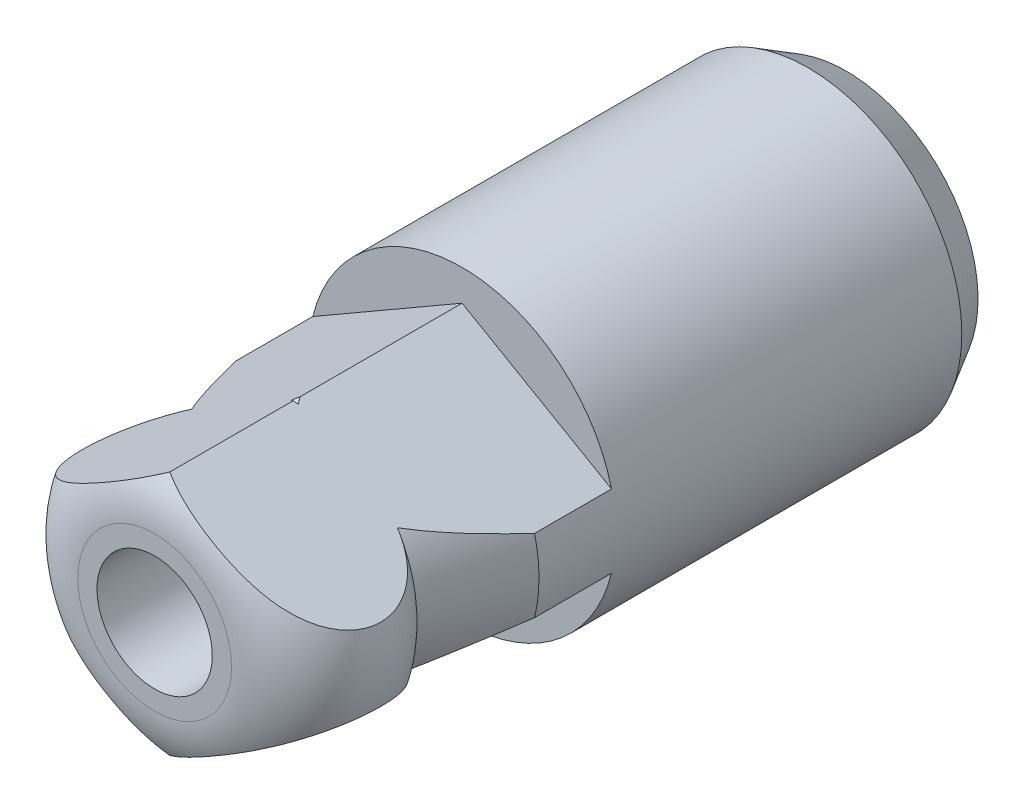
ISO-10303-21;
HEADER;
FILE_DESCRIPTION(('STEP AP214'),'2;1');
FILE_NAME('part.step','',(''),(''),'','','');
FILE_SCHEMA(('AUTOMOTIVE_DESIGN { 1 0 10303 214 1 1 1 1 }'));
ENDSEC;
DATA;
#1=APPLICATION_CONTEXT('core data for automotive mechanical design processes');
#2=APPLICATION_PROTOCOL_DEFINITION('international standard','automotive_design',2000,#1);
#3=PRODUCT_CONTEXT('',#1,'mechanical');
#4=PRODUCT('Part','Part','',(#3));
#5=PRODUCT_RELATED_PRODUCT_CATEGORY('part','',(#4));
#6=PRODUCT_DEFINITION_FORMATION('','',#4);
#7=PRODUCT_DEFINITION_CONTEXT('part definition',#1,'design');
#8=PRODUCT_DEFINITION('design','',#6,#7);
#9=PRODUCT_DEFINITION_SHAPE('','',#8);
#10=(LENGTH_UNIT() NAMED_UNIT(*) SI_UNIT(.MILLI.,.METRE.));
#11=(NAMED_UNIT(*) PLANE_ANGLE_UNIT() SI_UNIT($,.RADIAN.));
#12=(NAMED_UNIT(*) SI_UNIT($,.STERADIAN.) SOLID_ANGLE_UNIT());
#13=UNCERTAINTY_MEASURE_WITH_UNIT(LENGTH_MEASURE(1.E-05),#10,'distance_accuracy_value','');
#14=(GEOMETRIC_REPRESENTATION_CONTEXT(3) GLOBAL_UNCERTAINTY_ASSIGNED_CONTEXT((#13)) GLOBAL_UNIT_ASSIGNED_CONTEXT((#10,
#11,#12)) REPRESENTATION_CONTEXT('',''));
#15=CARTESIAN_POINT('',(0.,0.,0.));
#16=DIRECTION('',(0.,0.,1.));
#17=DIRECTION('',(1.,0.,0.));
#18=AXIS2_PLACEMENT_3D('',#15,#16,#17);
#19=CARTESIAN_POINT('',(0.,0.,14.3579455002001));
#20=DIRECTION('',(0.,0.,-1.));
#21=DIRECTION('',(0.,-1.,0.));
#22=AXIS2_PLACEMENT_3D('',#19,#20,#21);
#23=CONICAL_SURFACE('',#22,3.14177800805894,0.349065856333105);
#24=CARTESIAN_POINT('',(5.10090684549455,-0.248313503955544,8.95868747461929));
#25=CARTESIAN_POINT('',(5.02230281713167,-0.29369555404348,9.1682870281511));
#26=CARTESIAN_POINT('',(4.94310958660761,-0.339417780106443,9.37759561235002));
#27=CARTESIAN_POINT('',(4.78322479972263,-0.4317272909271,9.79548140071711));
#28=CARTESIAN_POINT('',(4.70253304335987,-0.478314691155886,10.0040585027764));
#29=CARTESIAN_POINT('',(4.53934034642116,-0.572534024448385,10.4203057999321));
#30=CARTESIAN_POINT('',(4.4568391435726,-0.620166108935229,10.6279758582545));
#31=CARTESIAN_POINT('',(4.28960424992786,-0.716719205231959,11.0420965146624));
#32=CARTESIAN_POINT('',(4.20487073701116,-0.765640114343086,11.2485472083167));
#33=CARTESIAN_POINT('',(4.03253434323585,-0.86513856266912,11.6599398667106));
#34=CARTESIAN_POINT('',(3.9449304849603,-0.915716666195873,11.8648812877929));
#35=CARTESIAN_POINT('',(3.76599563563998,-1.01902473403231,12.2726470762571));
#36=CARTESIAN_POINT('',(3.67466382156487,-1.07175517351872,12.4754709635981));
#37=CARTESIAN_POINT('',(3.48677846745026,-1.18023081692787,12.8785509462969));
#38=CARTESIAN_POINT('',(3.39021261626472,-1.23598312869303,13.078799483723));
#39=CARTESIAN_POINT('',(3.24005501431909,-1.32267664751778,13.3755398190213));
#40=CARTESIAN_POINT('',(3.18912863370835,-1.35207900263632,13.4738281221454));
#41=CARTESIAN_POINT('',(3.08510348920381,-1.41213793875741,13.6688555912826));
#42=CARTESIAN_POINT('',(3.03200491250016,-1.44279441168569,13.7655948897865));
#43=CARTESIAN_POINT('',(2.92275465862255,-1.50587006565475,13.9577003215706));
#44=CARTESIAN_POINT('',(2.86658468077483,-1.53829981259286,14.0530526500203));
#45=CARTESIAN_POINT('',(2.75077460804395,-1.60516277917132,14.2410168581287));
#46=CARTESIAN_POINT('',(2.69113246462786,-1.63959718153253,14.3336270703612));
#47=CARTESIAN_POINT('',(2.56772549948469,-1.71084621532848,14.5143853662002));
#48=CARTESIAN_POINT('',(2.50398309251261,-1.74764790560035,14.6025536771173));
#49=CARTESIAN_POINT('',(2.37078421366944,-1.82455030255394,14.772871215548));
#50=CARTESIAN_POINT('',(2.30133577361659,-1.86464637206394,14.8550286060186));
#51=CARTESIAN_POINT('',(2.17765147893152,-1.93605552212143,14.985605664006));
#52=CARTESIAN_POINT('',(2.12543669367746,-1.96620173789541,15.036549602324));
#53=CARTESIAN_POINT('',(2.0165315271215,-2.02907815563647,15.1319817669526));
#54=CARTESIAN_POINT('',(1.95983412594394,-2.06181241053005,15.1764595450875));
#55=CARTESIAN_POINT('',(1.84056307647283,-2.13067357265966,15.256434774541));
#56=CARTESIAN_POINT('',(1.77791312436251,-2.16684453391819,15.2917852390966));
#57=CARTESIAN_POINT('',(1.64796425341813,-2.24187053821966,15.3480027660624));
#58=CARTESIAN_POINT('',(1.58068691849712,-2.28071311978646,15.3689326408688));
#59=CARTESIAN_POINT('',(1.46217849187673,-2.34913398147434,15.3892478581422));
#60=CARTESIAN_POINT('',(1.41149721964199,-2.3783948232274,15.3929131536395));
#61=CARTESIAN_POINT('',(1.31033177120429,-2.4368027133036,15.3899827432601));
#62=CARTESIAN_POINT('',(1.25984770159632,-2.46594970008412,15.383382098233));
#63=CARTESIAN_POINT('',(1.16081838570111,-2.52312429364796,15.3608180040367));
#64=CARTESIAN_POINT('',(1.11226395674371,-2.55115720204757,15.3449065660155));
#65=CARTESIAN_POINT('',(1.01761286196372,-2.60580402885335,15.3054106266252));
#66=CARTESIAN_POINT('',(0.971516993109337,-2.63241748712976,15.281823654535));
#67=CARTESIAN_POINT('',(0.843528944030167,-2.70631141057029,15.2059057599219));
#68=CARTESIAN_POINT('',(0.764896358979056,-2.75170994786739,15.146286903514));
#69=CARTESIAN_POINT('',(0.653104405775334,-2.81625305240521,15.0477906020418));
#70=CARTESIAN_POINT('',(0.616775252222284,-2.83722769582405,15.0133398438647));
#71=CARTESIAN_POINT('',(0.545936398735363,-2.8781265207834,14.9420255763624));
#72=CARTESIAN_POINT('',(0.511426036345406,-2.89805108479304,14.9051629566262));
#73=CARTESIAN_POINT('',(0.42374636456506,-2.94867295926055,14.8068419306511));
#74=CARTESIAN_POINT('',(0.371823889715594,-2.97865040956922,14.7439125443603));
#75=CARTESIAN_POINT('',(0.271245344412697,-3.0367194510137,14.6146418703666));
#76=CARTESIAN_POINT('',(0.222591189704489,-3.06480993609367,14.5482986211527));
#77=CARTESIAN_POINT('',(0.127856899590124,-3.11950479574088,14.4129964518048));
#78=CARTESIAN_POINT('',(0.0817822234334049,-3.14610601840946,14.3440324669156));
#79=CARTESIAN_POINT('',(-0.00817110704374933,-3.19804059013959,14.2042139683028));
#80=CARTESIAN_POINT('',(-0.0520493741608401,-3.22337371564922,14.1333591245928));
#81=CARTESIAN_POINT('',(-0.181737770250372,-3.29824933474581,13.9173373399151));
#82=CARTESIAN_POINT('',(-0.26476492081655,-3.34618507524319,13.7699455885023));
#83=CARTESIAN_POINT('',(-0.425453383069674,-3.43895858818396,13.4716394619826));
#84=CARTESIAN_POINT('',(-0.503121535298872,-3.48380031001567,13.3207299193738));
#85=CARTESIAN_POINT('',(-0.664878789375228,-3.5771908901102,12.9955690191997));
#86=CARTESIAN_POINT('',(-0.748398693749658,-3.62541112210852,12.8209415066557));
#87=CARTESIAN_POINT('',(-0.911696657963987,-3.71969123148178,12.4693612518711));
#88=CARTESIAN_POINT('',(-0.991474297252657,-3.76575086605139,12.2924082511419));
#89=CARTESIAN_POINT('',(-1.14821908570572,-3.85624749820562,11.9366287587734));
#90=CARTESIAN_POINT('',(-1.22518328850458,-3.90068279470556,11.7578005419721));
#91=CARTESIAN_POINT('',(-1.37682566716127,-3.9882335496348,11.398855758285));
#92=CARTESIAN_POINT('',(-1.45150379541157,-4.03134898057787,11.218739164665));
#93=CARTESIAN_POINT('',(-1.59551033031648,-4.11449117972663,10.8660809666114));
#94=CARTESIAN_POINT('',(-1.66492436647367,-4.15456738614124,10.6935858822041));
#95=CARTESIAN_POINT('',(-1.80236420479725,-4.23391830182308,10.3478572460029));
#96=CARTESIAN_POINT('',(-1.87038998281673,-4.27319299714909,10.1746236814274));
#97=CARTESIAN_POINT('',(-2.00514633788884,-4.35099460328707,9.8278884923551));
#98=CARTESIAN_POINT('',(-2.07187916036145,-4.38952281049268,9.65438802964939));
#99=CARTESIAN_POINT('',(-2.20434844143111,-4.4660039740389,9.3068891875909));
#100=CARTESIAN_POINT('',(-2.27008494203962,-4.50395695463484,9.13289082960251));
#101=CARTESIAN_POINT('',(-2.33540821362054,-4.54167135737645,8.95868747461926));
#102=B_SPLINE_CURVE_WITH_KNOTS('',3,(#24,#25,#26,#27,#28,#29,#30,#31,#32,#33,#34,#35,#36,#37,
#38,#39,#40,#41,#42,#43,#44,#45,#46,#47,#48,#49,#50,#51,#52,#53,#54,#55,#56,#57,#58,#59,#60,#61,
#62,#63,#64,#65,#66,#67,#68,#69,#70,#71,#72,#73,#74,#75,#76,#77,#78,#79,#80,#81,#82,#83,#84,#85,
#86,#87,#88,#89,#90,#91,#92,#93,#94,#95,#96,#97,#98,#99,#100,#101),.UNSPECIFIED.,.F.,.F.,(4,2,2,
2,2,2,2,2,2,2,2,2,2,2,2,2,2,2,2,2,2,2,2,2,2,2,2,2,2,2,2,2,2,2,2,2,2,2,4),(0.,0.685227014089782,
1.3705461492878,2.05596528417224,2.74132996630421,3.42693050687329,4.11268323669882,
4.80012556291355,5.14370622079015,5.48725733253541,5.83314383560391,6.17923651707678,
6.52357599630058,6.86743882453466,7.10393082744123,7.34080081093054,7.5812760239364,
7.8206970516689,7.99573755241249,8.17086229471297,8.34501798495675,8.51922979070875,
8.84307091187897,9.00588925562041,9.16864788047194,9.42919365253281,9.68989083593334,
9.9511203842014,10.2123958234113,10.7396359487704,11.2661901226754,11.8645663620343,
12.4630096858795,13.0620627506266,13.6611282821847,14.2317417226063,14.8023650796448,
15.3718876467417,15.9413861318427),.UNSPECIFIED.);
#103=CARTESIAN_POINT('',(3.88555,-0.95,12.0000004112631));
#104=VERTEX_POINT('',#103);
#105=CARTESIAN_POINT('',(2.67390717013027,-1.64954220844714,14.3579455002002));
#106=VERTEX_POINT('',#105);
#107=EDGE_CURVE('E167',#104,#106,#102,.T.);
#108=ORIENTED_EDGE('',*,*,#107,.F.);
#109=CARTESIAN_POINT('',(0.,0.,12.));
#110=DIRECTION('',(0.,0.,-1.));
#111=DIRECTION('',(0.,-1.,0.));
#112=AXIS2_PLACEMENT_3D('',#109,#110,#111);
#113=CIRCLE('',#112,4.);
#114=CARTESIAN_POINT('',(3.88554999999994,0.949999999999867,12.0000004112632));
#115=VERTEX_POINT('',#114);
#116=EDGE_CURVE('E262',#115,#104,#113,.T.);
#117=ORIENTED_EDGE('',*,*,#116,.F.);
#118=CARTESIAN_POINT('',(-2.33540821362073,4.54167135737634,8.9586874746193));
#119=CARTESIAN_POINT('',(-2.25680418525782,4.4962893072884,9.16828702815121));
#120=CARTESIAN_POINT('',(-2.17761095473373,4.45056708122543,9.37759561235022));
#121=CARTESIAN_POINT('',(-2.01772616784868,4.35825757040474,9.79548140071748));
#122=CARTESIAN_POINT('',(-1.93703441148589,4.31167017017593,10.0040585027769));
#123=CARTESIAN_POINT('',(-1.77384171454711,4.2174508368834,10.4203057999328));
#124=CARTESIAN_POINT('',(-1.69134051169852,4.16981875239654,10.6279758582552));
#125=CARTESIAN_POINT('',(-1.5241056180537,4.07326565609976,11.0420965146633));
#126=CARTESIAN_POINT('',(-1.43937210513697,4.02434474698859,11.2485472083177));
#127=CARTESIAN_POINT('',(-1.26703571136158,3.92484629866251,11.6599398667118));
#128=CARTESIAN_POINT('',(-1.17943185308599,3.87426819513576,11.8648812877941));
#129=CARTESIAN_POINT('',(-1.00049700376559,3.77096012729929,12.2726470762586));
#130=CARTESIAN_POINT('',(-0.909165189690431,3.71822968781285,12.4754709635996));
#131=CARTESIAN_POINT('',(-0.721279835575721,3.60975404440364,12.8785509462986));
#132=CARTESIAN_POINT('',(-0.624713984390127,3.55400173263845,13.0787994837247));
#133=CARTESIAN_POINT('',(-0.474556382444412,3.46730821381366,13.3755398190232));
#134=CARTESIAN_POINT('',(-0.423630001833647,3.43790585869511,13.4738281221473));
#135=CARTESIAN_POINT('',(-0.319604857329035,3.37784692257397,13.6688555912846));
#136=CARTESIAN_POINT('',(-0.266506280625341,3.34719044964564,13.7655948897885));
#137=CARTESIAN_POINT('',(-0.157256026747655,3.28411479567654,13.9577003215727));
#138=CARTESIAN_POINT('',(-0.101086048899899,3.25168504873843,14.0530526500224));
#139=CARTESIAN_POINT('',(0.014724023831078,3.18482208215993,14.2410168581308));
#140=CARTESIAN_POINT('',(0.0743661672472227,3.15038767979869,14.3336270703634));
#141=CARTESIAN_POINT('',(0.197773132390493,3.07913864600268,14.5143853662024));
#142=CARTESIAN_POINT('',(0.261515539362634,3.04233695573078,14.6025536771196));
#143=CARTESIAN_POINT('',(0.394714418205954,2.96543455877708,14.7728712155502));
#144=CARTESIAN_POINT('',(0.464162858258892,2.92533848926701,14.8550286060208));
#145=CARTESIAN_POINT('',(0.587847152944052,2.85392933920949,14.985605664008));
#146=CARTESIAN_POINT('',(0.640061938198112,2.82378312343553,15.036549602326));
#147=CARTESIAN_POINT('',(0.748967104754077,2.76090670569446,15.1319817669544));
#148=CARTESIAN_POINT('',(0.805664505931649,2.72817245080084,15.1764595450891));
#149=CARTESIAN_POINT('',(0.924935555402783,2.65931128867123,15.2564347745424));
#150=CARTESIAN_POINT('',(0.987585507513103,2.62314032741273,15.2917852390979));
#151=CARTESIAN_POINT('',(1.11753437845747,2.54811432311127,15.3480027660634));
#152=CARTESIAN_POINT('',(1.18481171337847,2.50927174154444,15.3689326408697));
#153=CARTESIAN_POINT('',(1.30332013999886,2.44085087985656,15.3892478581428));
#154=CARTESIAN_POINT('',(1.35400141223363,2.41159003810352,15.3929131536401));
#155=CARTESIAN_POINT('',(1.45516686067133,2.35318214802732,15.3899827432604));
#156=CARTESIAN_POINT('',(1.50565093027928,2.32403516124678,15.3833820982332));
#157=CARTESIAN_POINT('',(1.60468024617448,2.26686056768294,15.3608180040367));
#158=CARTESIAN_POINT('',(1.65323467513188,2.23882765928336,15.3449065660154));
#159=CARTESIAN_POINT('',(1.74788576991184,2.18418083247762,15.3054106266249));
#160=CARTESIAN_POINT('',(1.79398163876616,2.15756737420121,15.2818236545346));
#161=CARTESIAN_POINT('',(1.92196968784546,2.08367345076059,15.2059057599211));
#162=CARTESIAN_POINT('',(2.00060227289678,2.0382749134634,15.1462869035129));
#163=CARTESIAN_POINT('',(2.11239422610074,1.97373180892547,15.0477906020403));
#164=CARTESIAN_POINT('',(2.14872337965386,1.95275716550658,15.0133398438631));
#165=CARTESIAN_POINT('',(2.21956223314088,1.91185834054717,14.9420255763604));
#166=CARTESIAN_POINT('',(2.25407259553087,1.89193377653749,14.905162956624));
#167=CARTESIAN_POINT('',(2.34175226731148,1.84131190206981,14.8068419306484));
#168=CARTESIAN_POINT('',(2.3936747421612,1.81133445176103,14.7439125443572));
#169=CARTESIAN_POINT('',(2.49425328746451,1.75326541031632,14.6146418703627));
#170=CARTESIAN_POINT('',(2.5429074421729,1.72517492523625,14.5482986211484));
#171=CARTESIAN_POINT('',(2.63764173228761,1.67048006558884,14.4129964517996));
#172=CARTESIAN_POINT('',(2.6837164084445,1.64387884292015,14.34403246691));
#173=CARTESIAN_POINT('',(2.77366973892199,1.59194427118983,14.2042139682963));
#174=CARTESIAN_POINT('',(2.81754800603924,1.56661114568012,14.133359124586));
#175=CARTESIAN_POINT('',(2.94723640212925,1.49173552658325,13.9173373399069));
#176=CARTESIAN_POINT('',(3.03026355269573,1.4437997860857,13.7699455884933));
#177=CARTESIAN_POINT('',(3.19095201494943,1.35102627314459,13.4716394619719));
#178=CARTESIAN_POINT('',(3.26862016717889,1.30618455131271,13.3207299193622));
#179=CARTESIAN_POINT('',(3.43037742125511,1.21279397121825,12.9955690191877));
#180=CARTESIAN_POINT('',(3.51389732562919,1.16457373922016,12.8209415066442));
#181=CARTESIAN_POINT('',(3.67719528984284,1.07029362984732,12.4693612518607));
#182=CARTESIAN_POINT('',(3.75697292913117,1.02423399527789,12.2924082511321));
#183=CARTESIAN_POINT('',(3.91371771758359,0.933737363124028,11.9366287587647));
#184=CARTESIAN_POINT('',(3.99068192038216,0.889302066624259,11.757800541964));
#185=CARTESIAN_POINT('',(4.14232429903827,0.801751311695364,11.398855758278));
#186=CARTESIAN_POINT('',(4.2170024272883,0.758635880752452,11.2187391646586));
#187=CARTESIAN_POINT('',(4.36100896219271,0.675493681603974,10.8660809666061));
#188=CARTESIAN_POINT('',(4.43042299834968,0.635417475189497,10.6935858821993));
#189=CARTESIAN_POINT('',(4.56786283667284,0.556066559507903,10.3478572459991));
#190=CARTESIAN_POINT('',(4.63588861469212,0.516791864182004,10.1746236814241));
#191=CARTESIAN_POINT('',(4.77064496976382,0.438990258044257,9.8278884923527));
#192=CARTESIAN_POINT('',(4.83737779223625,0.400462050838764,9.65438802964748));
#193=CARTESIAN_POINT('',(4.96984707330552,0.323980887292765,9.30688918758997));
#194=CARTESIAN_POINT('',(5.03558357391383,0.286027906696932,9.13289082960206));
#195=CARTESIAN_POINT('',(5.10090684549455,0.24831350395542,8.9586874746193));
#196=B_SPLINE_CURVE_WITH_KNOTS('',3,(#118,#119,#120,#121,#122,#123,#124,#125,#126,#127,#128,
#129,#130,#131,#132,#133,#134,#135,#136,#137,#138,#139,#140,#141,#142,#143,#144,#145,#146,#147,
#148,#149,#150,#151,#152,#153,#154,#155,#156,#157,#158,#159,#160,#161,#162,#163,#164,#165,#166,
#167,#168,#169,#170,#171,#172,#173,#174,#175,#176,#177,#178,#179,#180,#181,#182,#183,#184,#185,
#186,#187,#188,#189,#190,#191,#192,#193,#194,#195),.UNSPECIFIED.,.F.,.F.,(4,2,2,2,2,2,2,2,2,2,2,
2,2,2,2,2,2,2,2,2,2,2,2,2,2,2,2,2,2,2,2,2,2,2,2,2,2,2,4),(0.,0.685227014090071,1.37054614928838,
2.0559652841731,2.74132996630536,3.42693050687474,4.11268323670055,4.80012556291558,
5.14370622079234,5.48725733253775,5.83314383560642,6.17923651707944,6.5235759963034,
6.86743882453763,7.10393082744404,7.3408008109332,7.5812760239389,7.82069705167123,
7.99573755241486,8.17086229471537,8.34501798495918,8.5192297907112,8.84307091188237,
9.00588925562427,9.16864788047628,9.42919365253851,9.68989083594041,9.95112038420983,
10.2123958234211,10.739635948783,11.2661901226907,11.8645663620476,12.4630096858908,
13.0620627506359,13.661128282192,14.231741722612,14.8023650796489,15.3718876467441,
15.9413861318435),.UNSPECIFIED.);
#197=CARTESIAN_POINT('',(2.67390717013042,1.64954220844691,14.3579455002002));
#198=VERTEX_POINT('',#197);
#199=EDGE_CURVE('E108',#198,#115,#196,.T.);
#200=ORIENTED_EDGE('',*,*,#199,.F.);
#201=CARTESIAN_POINT('',(0.,0.,14.3579455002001));
#202=DIRECTION('',(0.,0.,-1.));
#203=DIRECTION('',(0.,-1.,0.));
#204=AXIS2_PLACEMENT_3D('',#201,#202,#203);
#205=CIRCLE('',#204,3.14177800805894);
#206=EDGE_CURVE('E255',#198,#106,#205,.T.);
#207=ORIENTED_EDGE('',*,*,#206,.T.);
#208=EDGE_LOOP('',(#108,#117,#200,#207));
#209=FACE_BOUND('',#208,.T.);
#210=ADVANCED_FACE('F14',(#209),#23,.T.);
#211=CARTESIAN_POINT('',(2.33540821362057,-4.54167135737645,8.95868747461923));
#212=CARTESIAN_POINT('',(2.25680418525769,-4.49628930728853,9.16828702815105));
#213=CARTESIAN_POINT('',(2.17761095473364,-4.45056708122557,9.37759561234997));
#214=CARTESIAN_POINT('',(2.01772616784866,-4.35825757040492,9.79548140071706));
#215=CARTESIAN_POINT('',(1.9370344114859,-4.31167017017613,10.0040585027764));
#216=CARTESIAN_POINT('',(1.77384171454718,-4.21745083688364,10.4203057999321));
#217=CARTESIAN_POINT('',(1.69134051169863,-4.1698187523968,10.6279758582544));
#218=CARTESIAN_POINT('',(1.52410561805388,-4.07326565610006,11.0420965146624));
#219=CARTESIAN_POINT('',(1.43937210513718,-4.02434474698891,11.2485472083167));
#220=CARTESIAN_POINT('',(1.26703571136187,-3.92484629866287,11.6599398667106));
#221=CARTESIAN_POINT('',(1.17943185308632,-3.87426819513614,11.8648812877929));
#222=CARTESIAN_POINT('',(1.00049700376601,-3.77096012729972,12.2726470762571));
#223=CARTESIAN_POINT('',(0.909165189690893,-3.71822968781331,12.4754709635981));
#224=CARTESIAN_POINT('',(0.721279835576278,-3.60975404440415,12.8785509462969));
#225=CARTESIAN_POINT('',(0.624713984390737,-3.554001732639,13.078799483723));
#226=CARTESIAN_POINT('',(0.474556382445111,-3.46730821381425,13.3755398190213));
#227=CARTESIAN_POINT('',(0.423630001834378,-3.43790585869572,13.4738281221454));
#228=CARTESIAN_POINT('',(0.319604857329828,-3.37784692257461,13.6688555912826));
#229=CARTESIAN_POINT('',(0.266506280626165,-3.34719044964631,13.7655948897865));
#230=CARTESIAN_POINT('',(0.157256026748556,-3.28411479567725,13.9577003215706));
#231=CARTESIAN_POINT('',(0.101086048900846,-3.25168504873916,14.0530526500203));
#232=CARTESIAN_POINT('',(-0.0147240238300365,-3.18482208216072,14.2410168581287));
#233=CARTESIAN_POINT('',(-0.0743661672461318,-3.1503876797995,14.3336270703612));
#234=CARTESIAN_POINT('',(-0.197773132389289,-3.07913864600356,14.5143853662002));
#235=CARTESIAN_POINT('',(-0.261515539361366,-3.0423369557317,14.6025536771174));
#236=CARTESIAN_POINT('',(-0.39471441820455,-2.96543455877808,14.772871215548));
#237=CARTESIAN_POINT('',(-0.464162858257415,-2.92533848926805,14.8550286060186));
#238=CARTESIAN_POINT('',(-0.587847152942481,-2.85392933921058,14.985605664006));
#239=CARTESIAN_POINT('',(-0.640061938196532,-2.82378312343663,15.036549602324));
#240=CARTESIAN_POINT('',(-0.748967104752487,-2.76090670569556,15.1319817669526));
#241=CARTESIAN_POINT('',(-0.805664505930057,-2.72817245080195,15.1764595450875));
#242=CARTESIAN_POINT('',(-0.924935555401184,-2.65931128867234,15.256434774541));
#243=CARTESIAN_POINT('',(-0.987585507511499,-2.62314032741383,15.2917852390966));
#244=CARTESIAN_POINT('',(-1.11753437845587,-2.54811432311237,15.3480027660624));
#245=CARTESIAN_POINT('',(-1.18481171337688,-2.50927174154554,15.3689326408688));
#246=CARTESIAN_POINT('',(-1.30332013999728,-2.44085087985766,15.3892478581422));
#247=CARTESIAN_POINT('',(-1.35400141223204,-2.41159003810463,15.3929131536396));
#248=CARTESIAN_POINT('',(-1.45516686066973,-2.35318214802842,15.3899827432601));
#249=CARTESIAN_POINT('',(-1.50565093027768,-2.32403516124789,15.383382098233));
#250=CARTESIAN_POINT('',(-1.6046802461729,-2.26686056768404,15.3608180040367));
#251=CARTESIAN_POINT('',(-1.65323467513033,-2.23882765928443,15.3449065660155));
#252=CARTESIAN_POINT('',(-1.74788576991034,-2.18418083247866,15.3054106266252));
#253=CARTESIAN_POINT('',(-1.79398163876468,-2.15756737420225,15.281823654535));
#254=CARTESIAN_POINT('',(-1.92196968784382,-2.08367345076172,15.2059057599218));
#255=CARTESIAN_POINT('',(-2.00060227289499,-2.03827491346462,15.146286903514));
#256=CARTESIAN_POINT('',(-2.11239422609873,-1.9737318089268,15.0477906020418));
#257=CARTESIAN_POINT('',(-2.14872337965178,-1.95275716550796,15.0133398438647));
#258=CARTESIAN_POINT('',(-2.21956223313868,-1.91185834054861,14.9420255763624));
#259=CARTESIAN_POINT('',(-2.25407259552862,-1.89193377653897,14.9051629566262));
#260=CARTESIAN_POINT('',(-2.34175226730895,-1.84131190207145,14.8068419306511));
#261=CARTESIAN_POINT('',(-2.39367474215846,-1.81133445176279,14.7439125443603));
#262=CARTESIAN_POINT('',(-2.49425328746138,-1.7532654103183,14.6146418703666));
#263=CARTESIAN_POINT('',(-2.54290744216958,-1.72517492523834,14.5482986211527));
#264=CARTESIAN_POINT('',(-2.63764173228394,-1.67048006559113,14.4129964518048));
#265=CARTESIAN_POINT('',(-2.68371640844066,-1.64387884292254,14.3440324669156));
#266=CARTESIAN_POINT('',(-2.77366973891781,-1.59194427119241,14.2042139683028));
#267=CARTESIAN_POINT('',(-2.8175480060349,-1.56661114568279,14.1333591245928));
#268=CARTESIAN_POINT('',(-2.94723640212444,-1.4917355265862,13.9173373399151));
#269=CARTESIAN_POINT('',(-3.03026355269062,-1.44379978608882,13.7699455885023));
#270=CARTESIAN_POINT('',(-3.19095201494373,-1.35102627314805,13.4716394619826));
#271=CARTESIAN_POINT('',(-3.2686201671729,-1.30618455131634,13.3207299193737));
#272=CARTESIAN_POINT('',(-3.43037742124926,-1.2127939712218,12.9955690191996));
#273=CARTESIAN_POINT('',(-3.51389732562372,-1.16457373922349,12.8209415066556));
#274=CARTESIAN_POINT('',(-3.67719528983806,-1.07029362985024,12.4693612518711));
#275=CARTESIAN_POINT('',(-3.75697292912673,-1.02423399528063,12.2924082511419));
#276=CARTESIAN_POINT('',(-3.91371771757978,-0.933737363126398,11.9366287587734));
#277=CARTESIAN_POINT('',(-3.99068192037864,-0.889302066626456,11.7578005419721));
#278=CARTESIAN_POINT('',(-4.14232429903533,-0.801751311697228,11.398855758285));
#279=CARTESIAN_POINT('',(-4.21700242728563,-0.758635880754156,11.218739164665));
#280=CARTESIAN_POINT('',(-4.36100896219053,-0.675493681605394,10.8660809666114));
#281=CARTESIAN_POINT('',(-4.43042299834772,-0.635417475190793,10.6935858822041));
#282=CARTESIAN_POINT('',(-4.5678628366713,-0.556066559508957,10.3478572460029));
#283=CARTESIAN_POINT('',(-4.63588861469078,-0.516791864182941,10.1746236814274));
#284=CARTESIAN_POINT('',(-4.77064496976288,-0.438990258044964,9.8278884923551));
#285=CARTESIAN_POINT('',(-4.8373777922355,-0.400462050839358,9.65438802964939));
#286=CARTESIAN_POINT('',(-4.96984707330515,-0.323980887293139,9.30688918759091));
#287=CARTESIAN_POINT('',(-5.03558357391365,-0.2860279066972,9.13289082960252));
#288=CARTESIAN_POINT('',(-5.10090684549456,-0.248313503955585,8.95868747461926));
#289=B_SPLINE_CURVE_WITH_KNOTS('',3,(#211,#212,#213,#214,#215,#216,#217,#218,#219,#220,#221,
#222,#223,#224,#225,#226,#227,#228,#229,#230,#231,#232,#233,#234,#235,#236,#237,#238,#239,#240,
#241,#242,#243,#244,#245,#246,#247,#248,#249,#250,#251,#252,#253,#254,#255,#256,#257,#258,#259,
#260,#261,#262,#263,#264,#265,#266,#267,#268,#269,#270,#271,#272,#273,#274,#275,#276,#277,#278,
#279,#280,#281,#282,#283,#284,#285,#286,#287,#288),.UNSPECIFIED.,.F.,.F.,(4,2,2,2,2,2,2,2,2,2,2,
2,2,2,2,2,2,2,2,2,2,2,2,2,2,2,2,2,2,2,2,2,2,2,2,2,2,2,4),(0.,0.68522701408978,1.37054614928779,
2.05596528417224,2.74132996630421,3.4269305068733,4.11268323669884,4.80012556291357,
5.14370622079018,5.48725733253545,5.83314383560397,6.17923651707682,6.52357599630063,
6.86743882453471,7.10393082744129,7.34080081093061,7.58127602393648,7.82069705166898,
7.99573755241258,8.17086229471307,8.34501798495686,8.51922979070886,8.84307091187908,
9.00588925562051,9.16864788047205,9.42919365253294,9.68989083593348,9.95112038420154,
10.2123958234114,10.7396359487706,11.2661901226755,11.8645663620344,12.4630096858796,
13.0620627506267,13.6611282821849,14.2317417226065,14.8023650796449,15.3718876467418,
15.9413861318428),.UNSPECIFIED.);
#290=CARTESIAN_POINT('',(-2.67390717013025,-1.64954220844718,14.3579455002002));
#291=VERTEX_POINT('',#290);
#292=CARTESIAN_POINT('',(-3.88555,-0.95,12.0000004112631));
#293=VERTEX_POINT('',#292);
#294=EDGE_CURVE('E175',#291,#293,#289,.T.);
#295=ORIENTED_EDGE('',*,*,#294,.F.);
#296=CARTESIAN_POINT('',(-2.67390717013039,1.64954220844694,14.3579455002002));
#297=VERTEX_POINT('',#296);
#298=EDGE_CURVE('E256',#291,#297,#205,.T.);
#299=ORIENTED_EDGE('',*,*,#298,.T.);
#300=CARTESIAN_POINT('',(-5.10090684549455,0.248313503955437,8.95868747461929));
#301=CARTESIAN_POINT('',(-5.02230281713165,0.293695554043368,9.16828702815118));
#302=CARTESIAN_POINT('',(-4.94310958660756,0.339417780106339,9.37759561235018));
#303=CARTESIAN_POINT('',(-4.78322479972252,0.431727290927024,9.79548140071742));
#304=CARTESIAN_POINT('',(-4.70253304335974,0.478314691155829,10.0040585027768));
#305=CARTESIAN_POINT('',(-4.53934034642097,0.572534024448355,10.4203057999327));
#306=CARTESIAN_POINT('',(-4.45683914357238,0.620166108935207,10.6279758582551));
#307=CARTESIAN_POINT('',(-4.28960424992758,0.716719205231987,11.0420965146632));
#308=CARTESIAN_POINT('',(-4.20487073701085,0.765640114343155,11.2485472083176));
#309=CARTESIAN_POINT('',(-4.03253434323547,0.865138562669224,11.6599398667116));
#310=CARTESIAN_POINT('',(-3.94493048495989,0.915716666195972,11.8648812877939));
#311=CARTESIAN_POINT('',(-3.7659956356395,1.01902473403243,12.2726470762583));
#312=CARTESIAN_POINT('',(-3.67466382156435,1.07175517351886,12.4754709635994));
#313=CARTESIAN_POINT('',(-3.48677846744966,1.18023081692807,12.8785509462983));
#314=CARTESIAN_POINT('',(-3.39021261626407,1.23598312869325,13.0787994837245));
#315=CARTESIAN_POINT('',(-3.24005501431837,1.32267664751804,13.3755398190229));
#316=CARTESIAN_POINT('',(-3.18912863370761,1.35207900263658,13.473828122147));
#317=CARTESIAN_POINT('',(-3.08510348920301,1.41213793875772,13.6688555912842));
#318=CARTESIAN_POINT('',(-3.03200491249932,1.44279441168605,13.7655948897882));
#319=CARTESIAN_POINT('',(-2.92275465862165,1.50587006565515,13.9577003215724));
#320=CARTESIAN_POINT('',(-2.8665846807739,1.53829981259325,14.0530526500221));
#321=CARTESIAN_POINT('',(-2.75077460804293,1.60516277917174,14.2410168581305));
#322=CARTESIAN_POINT('',(-2.69113246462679,1.63959718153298,14.333627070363));
#323=CARTESIAN_POINT('',(-2.56772549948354,1.71084621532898,14.5143853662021));
#324=CARTESIAN_POINT('',(-2.50398309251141,1.74764790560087,14.6025536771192));
#325=CARTESIAN_POINT('',(-2.37078421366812,1.82455030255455,14.7728712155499));
#326=CARTESIAN_POINT('',(-2.30133577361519,1.86464637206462,14.8550286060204));
#327=CARTESIAN_POINT('',(-2.17765147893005,1.93605552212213,14.9856056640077));
#328=CARTESIAN_POINT('',(-2.12543669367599,1.96620173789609,15.0365496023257));
#329=CARTESIAN_POINT('',(-2.01653152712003,2.02907815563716,15.1319817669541));
#330=CARTESIAN_POINT('',(-1.95983412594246,2.06181241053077,15.1764595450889));
#331=CARTESIAN_POINT('',(-1.84056307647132,2.13067357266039,15.2564347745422));
#332=CARTESIAN_POINT('',(-1.777913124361,2.16684453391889,15.2917852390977));
#333=CARTESIAN_POINT('',(-1.64796425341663,2.24187053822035,15.3480027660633));
#334=CARTESIAN_POINT('',(-1.58068691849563,2.28071311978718,15.3689326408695));
#335=CARTESIAN_POINT('',(-1.46217849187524,2.34913398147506,15.3892478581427));
#336=CARTESIAN_POINT('',(-1.41149721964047,2.3783948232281,15.39291315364));
#337=CARTESIAN_POINT('',(-1.31033177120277,2.4368027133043,15.3899827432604));
#338=CARTESIAN_POINT('',(-1.25984770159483,2.46594970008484,15.3833820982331));
#339=CARTESIAN_POINT('',(-1.16081838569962,2.52312429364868,15.3608180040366));
#340=CARTESIAN_POINT('',(-1.11226395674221,2.55115720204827,15.3449065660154));
#341=CARTESIAN_POINT('',(-1.01761286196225,2.60580402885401,15.305410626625));
#342=CARTESIAN_POINT('',(-0.971516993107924,2.63241748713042,15.2818236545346));
#343=CARTESIAN_POINT('',(-0.843528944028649,2.70631141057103,15.2059057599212));
#344=CARTESIAN_POINT('',(-0.764896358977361,2.7517099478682,15.1462869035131));
#345=CARTESIAN_POINT('',(-0.653104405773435,2.81625305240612,15.0477906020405));
#346=CARTESIAN_POINT('',(-0.616775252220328,2.83722769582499,15.0133398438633));
#347=CARTESIAN_POINT('',(-0.545936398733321,2.8781265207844,14.9420255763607));
#348=CARTESIAN_POINT('',(-0.511426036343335,2.89805108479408,14.9051629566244));
#349=CARTESIAN_POINT('',(-0.423746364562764,2.94867295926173,14.8068419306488));
#350=CARTESIAN_POINT('',(-0.371823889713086,2.97865040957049,14.7439125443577));
#351=CARTESIAN_POINT('',(-0.271245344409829,3.03671945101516,14.6146418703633));
#352=CARTESIAN_POINT('',(-0.222591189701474,3.06480993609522,14.5482986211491));
#353=CARTESIAN_POINT('',(-0.127856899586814,3.1195047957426,14.4129964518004));
#354=CARTESIAN_POINT('',(-0.0817822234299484,3.14610601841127,14.3440324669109));
#355=CARTESIAN_POINT('',(0.00817110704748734,3.19804059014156,14.2042139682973));
#356=CARTESIAN_POINT('',(0.0520493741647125,3.22337371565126,14.1333591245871));
#357=CARTESIAN_POINT('',(0.181737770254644,3.29824933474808,13.9173373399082));
#358=CARTESIAN_POINT('',(0.264764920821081,3.34618507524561,13.7699455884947));
#359=CARTESIAN_POINT('',(0.425453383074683,3.43895858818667,13.4716394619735));
#360=CARTESIAN_POINT('',(0.503121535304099,3.48380031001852,13.320729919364));
#361=CARTESIAN_POINT('',(0.664878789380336,3.57719089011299,12.9955690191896));
#362=CARTESIAN_POINT('',(0.748398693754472,3.62541112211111,12.820941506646));
#363=CARTESIAN_POINT('',(0.911696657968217,3.71969123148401,12.4693612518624));
#364=CARTESIAN_POINT('',(0.991474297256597,3.76575086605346,12.2924082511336));
#365=CARTESIAN_POINT('',(1.14821908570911,3.85624749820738,11.9366287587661));
#366=CARTESIAN_POINT('',(1.22518328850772,3.90068279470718,11.7578005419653));
#367=CARTESIAN_POINT('',(1.37682566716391,3.98823354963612,11.3988557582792));
#368=CARTESIAN_POINT('',(1.45150379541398,4.03134898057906,11.2187391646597));
#369=CARTESIAN_POINT('',(1.59551033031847,4.11449117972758,10.866080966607));
#370=CARTESIAN_POINT('',(1.66492436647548,4.15456738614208,10.6935858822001));
#371=CARTESIAN_POINT('',(1.80236420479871,4.23391830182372,10.3478572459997));
#372=CARTESIAN_POINT('',(1.87038998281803,4.27319299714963,10.1746236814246));
#373=CARTESIAN_POINT('',(2.0051463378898,4.35099460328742,9.82788849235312));
#374=CARTESIAN_POINT('',(2.07187916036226,4.38952281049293,9.65438802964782));
#375=CARTESIAN_POINT('',(2.2043484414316,4.46600397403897,9.30688918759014));
#376=CARTESIAN_POINT('',(2.27008494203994,4.50395695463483,9.13289082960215));
#377=CARTESIAN_POINT('',(2.33540821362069,4.54167135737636,8.9586874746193));
#378=B_SPLINE_CURVE_WITH_KNOTS('',3,(#300,#301,#302,#303,#304,#305,#306,#307,#308,#309,#310,
#311,#312,#313,#314,#315,#316,#317,#318,#319,#320,#321,#322,#323,#324,#325,#326,#327,#328,#329,
#330,#331,#332,#333,#334,#335,#336,#337,#338,#339,#340,#341,#342,#343,#344,#345,#346,#347,#348,
#349,#350,#351,#352,#353,#354,#355,#356,#357,#358,#359,#360,#361,#362,#363,#364,#365,#366,#367,
#368,#369,#370,#371,#372,#373,#374,#375,#376,#377),.UNSPECIFIED.,.F.,.F.,(4,2,2,2,2,2,2,2,2,2,2,
2,2,2,2,2,2,2,2,2,2,2,2,2,2,2,2,2,2,2,2,2,2,2,2,2,2,2,4),(0.,0.685227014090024,1.37054614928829,
2.05596528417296,2.74132996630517,3.4269305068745,4.11268323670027,4.80012556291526,
5.14370622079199,5.48725733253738,5.83314383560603,6.17923651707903,6.52357599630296,
6.86743882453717,7.1039308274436,7.34080081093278,7.58127602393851,7.82069705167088,
7.99573755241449,8.170862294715,8.3450179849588,8.51922979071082,8.84307091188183,
9.00588925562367,9.16864788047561,9.42919365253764,9.68989083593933,9.95112038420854,
10.2123958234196,10.739635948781,11.2661901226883,11.8645663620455,12.463009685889,
13.0620627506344,13.6611282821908,14.231741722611,14.8023650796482,15.3718876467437,
15.9413861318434),.UNSPECIFIED.);
#379=CARTESIAN_POINT('',(-3.88555,0.949999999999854,12.0000004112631));
#380=VERTEX_POINT('',#379);
#381=EDGE_CURVE('E200',#380,#297,#378,.T.);
#382=ORIENTED_EDGE('',*,*,#381,.F.);
#383=EDGE_CURVE('E267',#293,#380,#113,.T.);
#384=ORIENTED_EDGE('',*,*,#383,.F.);
#385=EDGE_LOOP('',(#295,#299,#382,#384));
#386=FACE_BOUND('',#385,.T.);
#387=ADVANCED_FACE('F186',(#386),#23,.T.);
#388=CARTESIAN_POINT('',(0.,0.,16.));
#389=DIRECTION('',(0.,0.,-1.));
#390=DIRECTION('',(0.,-1.,0.));
#391=AXIS2_PLACEMENT_3D('',#388,#389,#390);
#392=DEGENERATE_TOROIDAL_SURFACE('',#391,2.,2.,.T.);
#393=CARTESIAN_POINT('',(0.000199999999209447,-3.19343847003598,17.6049001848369));
#394=CARTESIAN_POINT('',(-0.0858339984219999,-3.143766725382,17.641798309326));
#395=CARTESIAN_POINT('',(-0.173430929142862,-3.09319262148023,17.6732906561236));
#396=CARTESIAN_POINT('',(-0.350480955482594,-2.99097275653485,17.7269880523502));
#397=CARTESIAN_POINT('',(-0.439927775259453,-2.93933061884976,17.7492203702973));
#398=CARTESIAN_POINT('',(-0.621559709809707,-2.83446538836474,17.7864558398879));
#399=CARTESIAN_POINT('',(-0.713765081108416,-2.78123060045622,17.8013208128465));
#400=CARTESIAN_POINT('',(-0.898856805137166,-2.67436785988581,17.8246221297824));
#401=CARTESIAN_POINT('',(-0.991743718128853,-2.62073958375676,17.8330523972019));
#402=CARTESIAN_POINT('',(-1.15483093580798,-2.526581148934,17.8429984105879));
#403=CARTESIAN_POINT('',(-1.22498089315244,-2.48608005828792,17.8457061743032));
#404=CARTESIAN_POINT('',(-1.36532656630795,-2.40505145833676,17.8481682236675));
#405=CARTESIAN_POINT('',(-1.43552228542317,-2.364523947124,17.8479222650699));
#406=CARTESIAN_POINT('',(-1.57592855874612,-2.28346035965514,17.8444592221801));
#407=CARTESIAN_POINT('',(-1.64613906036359,-2.24292431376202,17.8412392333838));
#408=CARTESIAN_POINT('',(-1.78639458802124,-2.16194775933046,17.8316033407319));
#409=CARTESIAN_POINT('',(-1.8564396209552,-2.12150724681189,17.8251875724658));
#410=CARTESIAN_POINT('',(-1.99567084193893,-2.04112207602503,17.8088173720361));
#411=CARTESIAN_POINT('',(-2.06485943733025,-2.00117602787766,17.7988913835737));
#412=CARTESIAN_POINT('',(-2.20270146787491,-1.92159290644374,17.7749505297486));
#413=CARTESIAN_POINT('',(-2.27135481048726,-1.88195588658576,17.760934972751));
#414=CARTESIAN_POINT('',(-2.4757184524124,-1.76396650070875,17.7118511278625));
#415=CARTESIAN_POINT('',(-2.61030815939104,-1.68626110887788,17.6696987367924));
#416=CARTESIAN_POINT('',(-2.83051409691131,-1.55912517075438,17.5781039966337));
#417=CARTESIAN_POINT('',(-2.91815200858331,-1.508527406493,17.5351879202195));
#418=CARTESIAN_POINT('',(-3.08774778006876,-1.41061125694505,17.4362952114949));
#419=CARTESIAN_POINT('',(-3.16971050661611,-1.36329006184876,17.3803299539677));
#420=CARTESIAN_POINT('',(-3.32596282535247,-1.27307775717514,17.2537044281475));
#421=CARTESIAN_POINT('',(-3.40017004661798,-1.23023420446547,17.1829065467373));
#422=CARTESIAN_POINT('',(-3.53642752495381,-1.15156592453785,17.0269859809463));
#423=CARTESIAN_POINT('',(-3.59848652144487,-1.11573615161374,16.9418736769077));
#424=CARTESIAN_POINT('',(-3.69485064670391,-1.06010030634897,16.778980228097));
#425=CARTESIAN_POINT('',(-3.73225669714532,-1.03850391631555,16.7036403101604));
#426=CARTESIAN_POINT('',(-3.79564700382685,-1.00190551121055,16.5468006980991));
#427=CARTESIAN_POINT('',(-3.82163884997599,-0.986899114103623,16.4653051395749));
#428=CARTESIAN_POINT('',(-3.86097339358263,-0.964189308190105,16.298016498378));
#429=CARTESIAN_POINT('',(-3.87427285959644,-0.956510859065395,16.2122097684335));
#430=CARTESIAN_POINT('',(-3.88734165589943,-0.948965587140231,16.0392231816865));
#431=CARTESIAN_POINT('',(-3.88711204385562,-0.949098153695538,15.9520434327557));
#432=CARTESIAN_POINT('',(-3.87355235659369,-0.956926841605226,15.7842042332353));
#433=CARTESIAN_POINT('',(-3.86098563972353,-0.964182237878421,15.7034606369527));
#434=CARTESIAN_POINT('',(-3.82448695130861,-0.985254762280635,15.5454916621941));
#435=CARTESIAN_POINT('',(-3.80055446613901,-0.999072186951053,15.4682664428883));
#436=CARTESIAN_POINT('',(-3.74186314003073,-1.03295763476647,15.317812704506));
#437=CARTESIAN_POINT('',(-3.70691116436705,-1.05313716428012,15.2446852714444));
#438=CARTESIAN_POINT('',(-3.62782557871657,-1.09879724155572,15.105465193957));
#439=CARTESIAN_POINT('',(-3.58369372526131,-1.12427677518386,15.0393712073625));
#440=CARTESIAN_POINT('',(-3.48294808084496,-1.1824422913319,14.9086865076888));
#441=CARTESIAN_POINT('',(-3.42552030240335,-1.21559822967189,14.8449366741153));
#442=CARTESIAN_POINT('',(-3.30342440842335,-1.28609031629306,14.7272336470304));
#443=CARTESIAN_POINT('',(-3.23873977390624,-1.32343600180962,14.6733035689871));
#444=CARTESIAN_POINT('',(-3.09363918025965,-1.4072098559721,14.5675175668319));
#445=CARTESIAN_POINT('',(-3.01234256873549,-1.45414646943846,14.5172945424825));
#446=CARTESIAN_POINT('',(-2.84554488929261,-1.55044714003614,14.4289299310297));
#447=CARTESIAN_POINT('',(-2.76007345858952,-1.59979408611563,14.3907143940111));
#448=CARTESIAN_POINT('',(-2.67338206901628,-1.64984537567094,14.3577455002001));
#449=B_SPLINE_CURVE_WITH_KNOTS('',3,(#393,#394,#395,#396,#397,#398,#399,#400,#401,#402,#403,
#404,#405,#406,#407,#408,#409,#410,#411,#412,#413,#414,#415,#416,#417,#418,#419,#420,#421,#422,
#423,#424,#425,#426,#427,#428,#429,#430,#431,#432,#433,#434,#435,#436,#437,#438,#439,#440,#441,
#442,#443,#444,#445,#446,#447,#448),.UNSPECIFIED.,.F.,.F.,(4,2,2,2,2,2,2,2,2,2,2,2,2,2,2,2,2,2,
2,2,2,2,2,2,2,2,2,4),(0.,0.317496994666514,0.634052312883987,0.956339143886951,1.27892994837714,
1.52202197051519,1.76513409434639,2.0084838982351,2.25182337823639,2.49323460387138,
2.73468668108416,3.21594453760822,3.54493385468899,3.87363746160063,4.20553764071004,
4.53719816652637,4.79661751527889,5.05586410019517,5.31599058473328,5.57609673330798,
5.82106205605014,6.06603844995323,6.31557249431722,6.56505883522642,6.83999118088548,
7.11556257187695,7.43407772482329,7.75059095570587),.UNSPECIFIED.);
#450=CARTESIAN_POINT('',(0.,-3.193323,17.6049860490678));
#451=VERTEX_POINT('',#450);
#452=EDGE_CURVE('E230',#451,#291,#449,.T.);
#453=ORIENTED_EDGE('',*,*,#452,.F.);
#454=CARTESIAN_POINT('',(2.6733820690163,-1.64984537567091,14.3577455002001));
#455=CARTESIAN_POINT('',(2.73324873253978,-1.61528134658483,14.3805368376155));
#456=CARTESIAN_POINT('',(2.79246986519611,-1.58109001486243,14.4057747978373));
#457=CARTESIAN_POINT('',(2.90916119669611,-1.51371825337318,14.4616843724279));
#458=CARTESIAN_POINT('',(2.96662544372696,-1.48054125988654,14.4923724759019));
#459=CARTESIAN_POINT('',(3.07945739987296,-1.41539770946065,14.5598817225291));
#460=CARTESIAN_POINT('',(3.13480240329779,-1.38344426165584,14.5967541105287));
#461=CARTESIAN_POINT('',(3.24193270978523,-1.32159255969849,14.6766934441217));
#462=CARTESIAN_POINT('',(3.29372272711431,-1.29169158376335,14.7197519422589));
#463=CARTESIAN_POINT('',(3.40837388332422,-1.22549771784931,14.826723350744));
#464=CARTESIAN_POINT('',(3.46964773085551,-1.1901212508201,14.8929513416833));
#465=CARTESIAN_POINT('',(3.58192486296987,-1.1252980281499,15.0358105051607));
#466=CARTESIAN_POINT('',(3.63296318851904,-1.09583104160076,15.1124046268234));
#467=CARTESIAN_POINT('',(3.72292205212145,-1.04389327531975,15.2755377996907));
#468=CARTESIAN_POINT('',(3.76174000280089,-1.02148172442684,15.3621531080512));
#469=CARTESIAN_POINT('',(3.82440453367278,-0.985302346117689,15.5424368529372));
#470=CARTESIAN_POINT('',(3.84824716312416,-0.971536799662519,15.6361071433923));
#471=CARTESIAN_POINT('',(3.87764299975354,-0.954565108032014,15.8163695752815));
#472=CARTESIAN_POINT('',(3.88493952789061,-0.950352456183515,15.9025858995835));
#473=CARTESIAN_POINT('',(3.88608627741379,-0.949690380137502,16.0751073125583));
#474=CARTESIAN_POINT('',(3.87994385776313,-0.953236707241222,16.1614123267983));
#475=CARTESIAN_POINT('',(3.85526764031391,-0.967483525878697,16.326689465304));
#476=CARTESIAN_POINT('',(3.83743551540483,-0.977778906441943,16.4058035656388));
#477=CARTESIAN_POINT('',(3.79092946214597,-1.004629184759,16.5596293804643));
#478=CARTESIAN_POINT('',(3.7622559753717,-1.0211838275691,16.6343412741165));
#479=CARTESIAN_POINT('',(3.69402700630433,-1.06057583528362,16.78045284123));
#480=CARTESIAN_POINT('',(3.65410159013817,-1.08362678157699,16.8516210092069));
#481=CARTESIAN_POINT('',(3.56551289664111,-1.13477347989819,16.9862909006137));
#482=CARTESIAN_POINT('',(3.51684269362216,-1.16287323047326,17.0497864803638));
#483=CARTESIAN_POINT('',(3.39268479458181,-1.23455581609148,17.1909011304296));
#484=CARTESIAN_POINT('',(3.31401225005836,-1.27997742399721,17.2647932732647));
#485=CARTESIAN_POINT('',(3.14742640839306,-1.37615579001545,17.3966651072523));
#486=CARTESIAN_POINT('',(3.05950926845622,-1.42691476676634,17.4546381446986));
#487=CARTESIAN_POINT('',(2.83403738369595,-1.55709100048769,17.5803623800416));
#488=CARTESIAN_POINT('',(2.69288821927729,-1.63858349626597,17.6394824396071));
#489=CARTESIAN_POINT('',(2.47656572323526,-1.76347732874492,17.7092936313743));
#490=CARTESIAN_POINT('',(2.40341206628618,-1.80571260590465,17.7294584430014));
#491=CARTESIAN_POINT('',(2.25612147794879,-1.89075085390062,17.7643185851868));
#492=CARTESIAN_POINT('',(2.18198469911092,-1.93355373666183,17.7790147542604));
#493=CARTESIAN_POINT('',(2.03456027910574,-2.01866925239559,17.8034979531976));
#494=CARTESIAN_POINT('',(1.96128309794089,-2.0609758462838,17.8133725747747));
#495=CARTESIAN_POINT('',(1.81440486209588,-2.14577602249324,17.8292515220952));
#496=CARTESIAN_POINT('',(1.74080374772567,-2.18826963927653,17.8352551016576));
#497=CARTESIAN_POINT('',(1.59333353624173,-2.27341159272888,17.8438229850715));
#498=CARTESIAN_POINT('',(1.51946419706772,-2.31606006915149,17.8463815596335));
#499=CARTESIAN_POINT('',(1.37170123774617,-2.40137104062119,17.8482380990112));
#500=CARTESIAN_POINT('',(1.29780762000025,-2.44403353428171,17.8475363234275));
#501=CARTESIAN_POINT('',(1.15055047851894,-2.52905247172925,17.8428320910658));
#502=CARTESIAN_POINT('',(1.07718648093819,-2.57140918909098,17.8388498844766));
#503=CARTESIAN_POINT('',(0.930655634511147,-2.65600879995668,17.8273147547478));
#504=CARTESIAN_POINT('',(0.85748880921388,-2.69825167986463,17.8197614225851));
#505=CARTESIAN_POINT('',(0.711716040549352,-2.78241361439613,17.800596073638));
#506=CARTESIAN_POINT('',(0.639109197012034,-2.82433318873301,17.7889933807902));
#507=CARTESIAN_POINT('',(0.494585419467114,-2.90777401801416,17.7610523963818));
#508=CARTESIAN_POINT('',(0.422668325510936,-2.94929536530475,17.7447152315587));
#509=CARTESIAN_POINT('',(0.291729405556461,-3.02489297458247,17.7096744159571));
#510=CARTESIAN_POINT('',(0.23254151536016,-3.05906511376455,17.691808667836));
#511=CARTESIAN_POINT('',(0.11525685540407,-3.12677943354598,17.6517340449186));
#512=CARTESIAN_POINT('',(0.0571605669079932,-3.16032133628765,17.6295233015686));
#513=CARTESIAN_POINT('',(-0.000199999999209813,-3.19343847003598,17.6049001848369));
#514=B_SPLINE_CURVE_WITH_KNOTS('',3,(#454,#455,#456,#457,#458,#459,#460,#461,#462,#463,#464,
#465,#466,#467,#468,#469,#470,#471,#472,#473,#474,#475,#476,#477,#478,#479,#480,#481,#482,#483,
#484,#485,#486,#487,#488,#489,#490,#491,#492,#493,#494,#495,#496,#497,#498,#499,#500,#501,#502,
#503,#504,#505,#506,#507,#508,#509,#510,#511,#512,#513),.UNSPECIFIED.,.F.,.F.,(4,2,2,2,2,2,2,2,
2,2,2,2,2,2,2,2,2,2,2,2,2,2,2,2,2,2,2,2,2,4),(0.,0.218406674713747,0.437485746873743,
0.658479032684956,0.879173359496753,1.1687246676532,1.4572671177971,1.74817093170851,
2.03915145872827,2.29767716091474,2.55606133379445,2.80020340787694,3.0443355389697,
3.29768365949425,3.55123331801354,3.90057312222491,4.25005871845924,4.76705087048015,
5.02748416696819,5.28787751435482,5.54334592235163,5.79886355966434,6.0548056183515,
6.31072729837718,6.56508090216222,6.81946364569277,7.0732644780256,7.32700495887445,
7.53879154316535,7.75066940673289),.UNSPECIFIED.);
#515=EDGE_CURVE('E129',#106,#451,#514,.T.);
#516=ORIENTED_EDGE('',*,*,#515,.F.);
#517=ORIENTED_EDGE('',*,*,#206,.F.);
#518=CARTESIAN_POINT('',(-0.000199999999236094,3.19343847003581,17.6049001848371));
#519=CARTESIAN_POINT('',(0.0858339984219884,3.14376672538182,17.6417983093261));
#520=CARTESIAN_POINT('',(0.173430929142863,3.09319262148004,17.6732906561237));
#521=CARTESIAN_POINT('',(0.350480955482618,2.99097275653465,17.7269880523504));
#522=CARTESIAN_POINT('',(0.439927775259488,2.93933061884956,17.7492203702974));
#523=CARTESIAN_POINT('',(0.621559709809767,2.83446538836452,17.786455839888));
#524=CARTESIAN_POINT('',(0.71376508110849,2.781230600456,17.8013208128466));
#525=CARTESIAN_POINT('',(0.898856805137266,2.67436785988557,17.8246221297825));
#526=CARTESIAN_POINT('',(0.991743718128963,2.62073958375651,17.833052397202));
#527=CARTESIAN_POINT('',(1.1548309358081,2.52658114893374,17.842998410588));
#528=CARTESIAN_POINT('',(1.22498089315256,2.48608005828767,17.8457061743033));
#529=CARTESIAN_POINT('',(1.36532656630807,2.40505145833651,17.8481682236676));
#530=CARTESIAN_POINT('',(1.43552228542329,2.36452394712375,17.84792226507));
#531=CARTESIAN_POINT('',(1.57592855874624,2.28346035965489,17.8444592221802));
#532=CARTESIAN_POINT('',(1.64613906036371,2.24292431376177,17.8412392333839));
#533=CARTESIAN_POINT('',(1.78639458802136,2.16194775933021,17.8316033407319));
#534=CARTESIAN_POINT('',(1.85643962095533,2.12150724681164,17.8251875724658));
#535=CARTESIAN_POINT('',(1.99567084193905,2.04112207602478,17.8088173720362));
#536=CARTESIAN_POINT('',(2.06485943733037,2.00117602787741,17.7988913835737));
#537=CARTESIAN_POINT('',(2.20270146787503,1.9215929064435,17.7749505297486));
#538=CARTESIAN_POINT('',(2.27135481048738,1.88195588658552,17.760934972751));
#539=CARTESIAN_POINT('',(2.47571845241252,1.76396650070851,17.7118511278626));
#540=CARTESIAN_POINT('',(2.61030815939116,1.68626110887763,17.6696987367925));
#541=CARTESIAN_POINT('',(2.83051409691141,1.55912517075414,17.5781039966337));
#542=CARTESIAN_POINT('',(2.91815200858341,1.50852740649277,17.5351879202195));
#543=CARTESIAN_POINT('',(3.08774778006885,1.41061125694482,17.4362952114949));
#544=CARTESIAN_POINT('',(3.16971050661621,1.36329006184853,17.3803299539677));
#545=CARTESIAN_POINT('',(3.32596282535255,1.27307775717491,17.2537044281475));
#546=CARTESIAN_POINT('',(3.40017004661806,1.23023420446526,17.1829065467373));
#547=CARTESIAN_POINT('',(3.53642752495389,1.15156592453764,17.0269859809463));
#548=CARTESIAN_POINT('',(3.59848652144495,1.11573615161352,16.9418736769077));
#549=CARTESIAN_POINT('',(3.69485064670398,1.06010030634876,16.778980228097));
#550=CARTESIAN_POINT('',(3.73225669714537,1.03850391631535,16.7036403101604));
#551=CARTESIAN_POINT('',(3.79564700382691,1.00190551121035,16.5468006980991));
#552=CARTESIAN_POINT('',(3.82163884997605,0.986899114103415,16.4653051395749));
#553=CARTESIAN_POINT('',(3.86097339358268,0.964189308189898,16.298016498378));
#554=CARTESIAN_POINT('',(3.87427285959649,0.956510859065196,16.2122097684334));
#555=CARTESIAN_POINT('',(3.88734165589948,0.948965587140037,16.0392231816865));
#556=CARTESIAN_POINT('',(3.88711204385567,0.949098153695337,15.9520434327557));
#557=CARTESIAN_POINT('',(3.87355235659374,0.956926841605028,15.7842042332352));
#558=CARTESIAN_POINT('',(3.86098563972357,0.964182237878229,15.7034606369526));
#559=CARTESIAN_POINT('',(3.82448695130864,0.985254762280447,15.5454916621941));
#560=CARTESIAN_POINT('',(3.80055446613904,0.999072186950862,15.4682664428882));
#561=CARTESIAN_POINT('',(3.74186314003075,1.03295763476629,15.317812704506));
#562=CARTESIAN_POINT('',(3.70691116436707,1.05313716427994,15.2446852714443));
#563=CARTESIAN_POINT('',(3.62782557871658,1.09879724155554,15.105465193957));
#564=CARTESIAN_POINT('',(3.58369372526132,1.12427677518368,15.0393712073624));
#565=CARTESIAN_POINT('',(3.48294808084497,1.18244229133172,14.9086865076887));
#566=CARTESIAN_POINT('',(3.42552030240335,1.21559822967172,14.8449366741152));
#567=CARTESIAN_POINT('',(3.30342440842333,1.2860903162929,14.7272336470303));
#568=CARTESIAN_POINT('',(3.23873977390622,1.32343600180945,14.673303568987));
#569=CARTESIAN_POINT('',(3.09363918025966,1.40720985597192,14.5675175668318));
#570=CARTESIAN_POINT('',(3.01234256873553,1.45414646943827,14.5172945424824));
#571=CARTESIAN_POINT('',(2.84554488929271,1.55044714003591,14.4289299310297));
#572=CARTESIAN_POINT('',(2.76007345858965,1.59979408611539,14.3907143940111));
#573=CARTESIAN_POINT('',(2.67338206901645,1.64984537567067,14.3577455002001));
#574=B_SPLINE_CURVE_WITH_KNOTS('',3,(#518,#519,#520,#521,#522,#523,#524,#525,#526,#527,#528,
#529,#530,#531,#532,#533,#534,#535,#536,#537,#538,#539,#540,#541,#542,#543,#544,#545,#546,#547,
#548,#549,#550,#551,#552,#553,#554,#555,#556,#557,#558,#559,#560,#561,#562,#563,#564,#565,#566,
#567,#568,#569,#570,#571,#572,#573),.UNSPECIFIED.,.F.,.F.,(4,2,2,2,2,2,2,2,2,2,2,2,2,2,2,2,2,2,
2,2,2,2,2,2,2,2,2,4),(0.,0.317496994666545,0.634052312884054,0.956339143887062,1.27892994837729,
1.52202197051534,1.76513409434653,2.00848389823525,2.25182337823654,2.49323460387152,
2.73468668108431,3.21594453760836,3.54493385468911,3.87363746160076,4.20553764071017,
4.53719816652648,4.796617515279,5.05586410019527,5.31599058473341,5.57609673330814,
5.8210620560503,6.06603844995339,6.3155724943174,6.56505883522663,6.83999118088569,
7.11556257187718,7.4340777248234,7.75059095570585),.UNSPECIFIED.);
#575=CARTESIAN_POINT('',(0.,3.19332299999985,17.6049860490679));
#576=VERTEX_POINT('',#575);
#577=EDGE_CURVE('E231',#576,#198,#574,.T.);
#578=ORIENTED_EDGE('',*,*,#577,.F.);
#579=CARTESIAN_POINT('',(-2.67338206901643,1.6498453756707,14.3577455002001));
#580=CARTESIAN_POINT('',(-2.7332487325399,1.61528134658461,14.3805368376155));
#581=CARTESIAN_POINT('',(-2.79246986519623,1.58109001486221,14.4057747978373));
#582=CARTESIAN_POINT('',(-2.90916119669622,1.51371825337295,14.4616843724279));
#583=CARTESIAN_POINT('',(-2.96662544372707,1.48054125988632,14.4923724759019));
#584=CARTESIAN_POINT('',(-3.07945739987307,1.41539770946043,14.5598817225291));
#585=CARTESIAN_POINT('',(-3.13480240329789,1.38344426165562,14.5967541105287));
#586=CARTESIAN_POINT('',(-3.24193270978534,1.32159255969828,14.6766934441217));
#587=CARTESIAN_POINT('',(-3.29372272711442,1.29169158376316,14.719751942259));
#588=CARTESIAN_POINT('',(-3.40837388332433,1.22549771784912,14.826723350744));
#589=CARTESIAN_POINT('',(-3.4696477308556,1.1901212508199,14.8929513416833));
#590=CARTESIAN_POINT('',(-3.58192486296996,1.1252980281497,15.0358105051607));
#591=CARTESIAN_POINT('',(-3.63296318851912,1.09583104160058,15.1124046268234));
#592=CARTESIAN_POINT('',(-3.72292205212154,1.04389327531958,15.2755377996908));
#593=CARTESIAN_POINT('',(-3.76174000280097,1.02148172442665,15.3621531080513));
#594=CARTESIAN_POINT('',(-3.82440453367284,0.985302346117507,15.5424368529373));
#595=CARTESIAN_POINT('',(-3.84824716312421,0.971536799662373,15.6361071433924));
#596=CARTESIAN_POINT('',(-3.87764299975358,0.954565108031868,15.8163695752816));
#597=CARTESIAN_POINT('',(-3.88493952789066,0.950352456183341,15.9025858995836));
#598=CARTESIAN_POINT('',(-3.88608627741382,0.949690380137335,16.0751073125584));
#599=CARTESIAN_POINT('',(-3.87994385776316,0.953236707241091,16.1614123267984));
#600=CARTESIAN_POINT('',(-3.85526764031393,0.967483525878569,16.3266894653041));
#601=CARTESIAN_POINT('',(-3.83743551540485,0.977778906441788,16.4058035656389));
#602=CARTESIAN_POINT('',(-3.79092946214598,1.00462918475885,16.5596293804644));
#603=CARTESIAN_POINT('',(-3.7622559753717,1.02118382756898,16.6343412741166));
#604=CARTESIAN_POINT('',(-3.69402700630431,1.0605758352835,16.7804528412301));
#605=CARTESIAN_POINT('',(-3.65410159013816,1.08362678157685,16.851621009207));
#606=CARTESIAN_POINT('',(-3.56551289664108,1.13477347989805,16.9862909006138));
#607=CARTESIAN_POINT('',(-3.51684269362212,1.16287323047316,17.0497864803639));
#608=CARTESIAN_POINT('',(-3.39268479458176,1.23455581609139,17.1909011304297));
#609=CARTESIAN_POINT('',(-3.3140122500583,1.27997742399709,17.2647932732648));
#610=CARTESIAN_POINT('',(-3.14742640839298,1.37615579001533,17.3966651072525));
#611=CARTESIAN_POINT('',(-3.05950926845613,1.42691476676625,17.4546381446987));
#612=CARTESIAN_POINT('',(-2.83403738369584,1.55709100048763,17.5803623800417));
#613=CARTESIAN_POINT('',(-2.69288821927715,1.6385834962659,17.6394824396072));
#614=CARTESIAN_POINT('',(-2.4765657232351,1.76347732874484,17.7092936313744));
#615=CARTESIAN_POINT('',(-2.40341206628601,1.80571260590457,17.7294584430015));
#616=CARTESIAN_POINT('',(-2.25612147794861,1.89075085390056,17.7643185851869));
#617=CARTESIAN_POINT('',(-2.18198469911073,1.9335537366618,17.7790147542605));
#618=CARTESIAN_POINT('',(-2.03456027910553,2.01866925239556,17.8034979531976));
#619=CARTESIAN_POINT('',(-1.96128309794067,2.06097584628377,17.8133725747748));
#620=CARTESIAN_POINT('',(-1.81440486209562,2.14577602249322,17.8292515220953));
#621=CARTESIAN_POINT('',(-1.7408037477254,2.18826963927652,17.8352551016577));
#622=CARTESIAN_POINT('',(-1.59333353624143,2.27341159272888,17.8438229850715));
#623=CARTESIAN_POINT('',(-1.51946419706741,2.3160600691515,17.8463815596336));
#624=CARTESIAN_POINT('',(-1.37170123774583,2.40137104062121,17.8482380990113));
#625=CARTESIAN_POINT('',(-1.2978076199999,2.44403353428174,17.8475363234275));
#626=CARTESIAN_POINT('',(-1.15055047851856,2.5290524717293,17.8428320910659));
#627=CARTESIAN_POINT('',(-1.0771864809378,2.57140918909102,17.8388498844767));
#628=CARTESIAN_POINT('',(-0.930655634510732,2.65600879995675,17.8273147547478));
#629=CARTESIAN_POINT('',(-0.857488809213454,2.6982516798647,17.8197614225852));
#630=CARTESIAN_POINT('',(-0.711716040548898,2.78241361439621,17.800596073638));
#631=CARTESIAN_POINT('',(-0.639109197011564,2.8243331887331,17.7889933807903));
#632=CARTESIAN_POINT('',(-0.494585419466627,2.90777401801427,17.7610523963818));
#633=CARTESIAN_POINT('',(-0.422668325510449,2.94929536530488,17.7447152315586));
#634=CARTESIAN_POINT('',(-0.291729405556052,3.02489297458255,17.7096744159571));
#635=CARTESIAN_POINT('',(-0.232541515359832,3.05906511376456,17.691808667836));
#636=CARTESIAN_POINT('',(-0.115256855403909,3.12677943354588,17.6517340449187));
#637=CARTESIAN_POINT('',(-0.0571605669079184,3.1603213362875,17.6295233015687));
#638=CARTESIAN_POINT('',(0.000199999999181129,3.19343847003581,17.6049001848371));
#639=B_SPLINE_CURVE_WITH_KNOTS('',3,(#579,#580,#581,#582,#583,#584,#585,#586,#587,#588,#589,
#590,#591,#592,#593,#594,#595,#596,#597,#598,#599,#600,#601,#602,#603,#604,#605,#606,#607,#608,
#609,#610,#611,#612,#613,#614,#615,#616,#617,#618,#619,#620,#621,#622,#623,#624,#625,#626,#627,
#628,#629,#630,#631,#632,#633,#634,#635,#636,#637,#638),.UNSPECIFIED.,.F.,.F.,(4,2,2,2,2,2,2,2,
2,2,2,2,2,2,2,2,2,2,2,2,2,2,2,2,2,2,2,2,2,4),(0.,0.218406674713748,0.437485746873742,
0.658479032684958,0.879173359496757,1.1687246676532,1.45726711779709,1.74817093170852,
2.0391514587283,2.29767716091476,2.55606133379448,2.80020340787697,3.04433553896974,
3.29768365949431,3.55123331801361,3.90057312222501,4.25005871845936,4.76705087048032,
5.02748416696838,5.28787751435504,5.54334592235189,5.79886355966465,6.05480561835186,
6.31072729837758,6.56508090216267,6.81946364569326,7.07326447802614,7.32700495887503,
7.53879154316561,7.75066940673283),.UNSPECIFIED.);
#640=EDGE_CURVE('E223',#297,#576,#639,.T.);
#641=ORIENTED_EDGE('',*,*,#640,.F.);
#642=ORIENTED_EDGE('',*,*,#298,.F.);
#643=EDGE_LOOP('',(#453,#516,#517,#578,#641,#642));
#644=FACE_BOUND('',#643,.T.);
#645=CARTESIAN_POINT('',(0.,0.,18.));
#646=DIRECTION('',(0.,0.,-1.));
#647=DIRECTION('',(0.,-1.,0.));
#648=AXIS2_PLACEMENT_3D('',#645,#646,#647);
#649=CIRCLE('',#648,2.);
#650=CARTESIAN_POINT('',(0.,-2.,18.));
#651=VERTEX_POINT('',#650);
#652=EDGE_CURVE('E181',#651,#651,#649,.T.);
#653=ORIENTED_EDGE('',*,*,#652,.T.);
#654=EDGE_LOOP('',(#653));
#655=FACE_BOUND('',#654,.T.);
#656=ADVANCED_FACE('F319',(#644,#655),#392,.T.);
#657=CARTESIAN_POINT('',(-2.,0.,18.));
#658=DIRECTION('',(0.,0.,-1.));
#659=DIRECTION('',(0.,-1.,0.));
#660=AXIS2_PLACEMENT_3D('',#657,#658,#659);
#661=PLANE('',#660);
#662=CARTESIAN_POINT('',(0.,0.,18.));
#663=DIRECTION('',(0.,0.,1.));
#664=DIRECTION('',(0.,1.,0.));
#665=AXIS2_PLACEMENT_3D('',#662,#663,#664);
#666=CIRCLE('',#665,1.5);
#667=CARTESIAN_POINT('',(0.,1.5,18.));
#668=VERTEX_POINT('',#667);
#669=EDGE_CURVE('E304',#668,#668,#666,.T.);
#670=ORIENTED_EDGE('',*,*,#669,.F.);
#671=EDGE_LOOP('',(#670));
#672=FACE_BOUND('',#671,.T.);
#673=ORIENTED_EDGE('',*,*,#652,.F.);
#674=EDGE_LOOP('',(#673));
#675=FACE_BOUND('',#674,.T.);
#676=ADVANCED_FACE('F16',(#672,#675),#661,.F.);
#677=CARTESIAN_POINT('',(-3.42264999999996,0.,0.));
#678=DIRECTION('',(0.,0.,1.));
#679=DIRECTION('',(0.,1.,0.));
#680=AXIS2_PLACEMENT_3D('',#677,#678,#679);
#681=PLANE('',#680);
#682=CARTESIAN_POINT('',(0.,0.,0.));
#683=DIRECTION('',(0.,0.,-1.));
#684=DIRECTION('',(0.,-1.,0.));
#685=AXIS2_PLACEMENT_3D('',#682,#683,#684);
#686=CIRCLE('',#685,3.42264999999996);
#687=CARTESIAN_POINT('',(0.,-3.42264999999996,0.));
#688=VERTEX_POINT('',#687);
#689=EDGE_CURVE('E278',#688,#688,#686,.T.);
#690=ORIENTED_EDGE('',*,*,#689,.T.);
#691=EDGE_LOOP('',(#690));
#692=FACE_BOUND('',#691,.T.);
#693=ADVANCED_FACE('F318',(#692),#681,.F.);
#694=CARTESIAN_POINT('',(0.,0.,1.));
#695=DIRECTION('',(0.,0.,1.));
#696=DIRECTION('',(0.,1.,0.));
#697=AXIS2_PLACEMENT_3D('',#694,#695,#696);
#698=CONICAL_SURFACE('',#697,4.,0.523598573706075);
#699=ORIENTED_EDGE('',*,*,#689,.F.);
#700=EDGE_LOOP('',(#699));
#701=FACE_BOUND('',#700,.T.);
#702=CARTESIAN_POINT('',(0.,0.,1.));
#703=DIRECTION('',(0.,0.,-1.));
#704=DIRECTION('',(0.,-1.,0.));
#705=AXIS2_PLACEMENT_3D('',#702,#703,#704);
#706=CIRCLE('',#705,4.);
#707=CARTESIAN_POINT('',(0.,-4.,1.));
#708=VERTEX_POINT('',#707);
#709=EDGE_CURVE('E280',#708,#708,#706,.T.);
#710=ORIENTED_EDGE('',*,*,#709,.T.);
#711=EDGE_LOOP('',(#710));
#712=FACE_BOUND('',#711,.T.);
#713=ADVANCED_FACE('F385',(#701,#712),#698,.T.);
#714=CARTESIAN_POINT('',(0.,0.,0.));
#715=DIRECTION('',(0.,0.,-1.));
#716=DIRECTION('',(0.,-1.,0.));
#717=AXIS2_PLACEMENT_3D('',#714,#715,#716);
#718=CYLINDRICAL_SURFACE('',#717,4.);
#719=DIRECTION('',(0.,0.,1.));
#720=VECTOR('',#719,1.);
#721=CARTESIAN_POINT('',(3.88555,-0.95,10.));
#722=LINE('',#721,#720);
#723=CARTESIAN_POINT('',(3.88555,-0.95,10.));
#724=VERTEX_POINT('',#723);
#725=EDGE_CURVE('E296',#724,#104,#722,.T.);
#726=ORIENTED_EDGE('',*,*,#725,.F.);
#727=CARTESIAN_POINT('',(0.,0.,10.));
#728=DIRECTION('',(0.,0.,1.));
#729=DIRECTION('',(0.,1.,0.));
#730=AXIS2_PLACEMENT_3D('',#727,#728,#729);
#731=CIRCLE('',#730,4.);
#732=CARTESIAN_POINT('',(-3.88555,-0.95,10.));
#733=VERTEX_POINT('',#732);
#734=EDGE_CURVE('E9',#733,#724,#731,.T.);
#735=ORIENTED_EDGE('',*,*,#734,.F.);
#736=DIRECTION('',(0.,0.,1.));
#737=VECTOR('',#736,1.);
#738=CARTESIAN_POINT('',(-3.88555,-0.95,10.));
#739=LINE('',#738,#737);
#740=EDGE_CURVE('E251',#733,#293,#739,.T.);
#741=ORIENTED_EDGE('',*,*,#740,.T.);
#742=ORIENTED_EDGE('',*,*,#383,.T.);
#743=DIRECTION('',(0.,0.,1.));
#744=VECTOR('',#743,1.);
#745=CARTESIAN_POINT('',(-3.88555,0.949999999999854,10.));
#746=LINE('',#745,#744);
#747=CARTESIAN_POINT('',(-3.88555,0.949999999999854,10.));
#748=VERTEX_POINT('',#747);
#749=EDGE_CURVE('E128',#748,#380,#746,.T.);
#750=ORIENTED_EDGE('',*,*,#749,.F.);
#751=CARTESIAN_POINT('',(3.88554999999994,0.949999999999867,10.));
#752=VERTEX_POINT('',#751);
#753=EDGE_CURVE('E18',#752,#748,#731,.T.);
#754=ORIENTED_EDGE('',*,*,#753,.F.);
#755=DIRECTION('',(0.,0.,1.));
#756=VECTOR('',#755,1.);
#757=CARTESIAN_POINT('',(3.88554999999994,0.949999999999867,10.));
#758=LINE('',#757,#756);
#759=EDGE_CURVE('E103',#752,#115,#758,.T.);
#760=ORIENTED_EDGE('',*,*,#759,.T.);
#761=ORIENTED_EDGE('',*,*,#116,.T.);
#762=EDGE_LOOP('',(#726,#735,#741,#742,#750,#754,#760,#761));
#763=FACE_BOUND('',#762,.T.);
#764=ORIENTED_EDGE('',*,*,#709,.F.);
#765=EDGE_LOOP('',(#764));
#766=FACE_BOUND('',#765,.T.);
#767=ADVANCED_FACE('F125',(#763,#766),#718,.T.);
#768=CARTESIAN_POINT('',(3.88554999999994,0.949999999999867,10.));
#769=DIRECTION('',(0.49999994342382,0.866025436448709,0.));
#770=DIRECTION('',(-0.866025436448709,0.49999994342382,0.));
#771=AXIS2_PLACEMENT_3D('',#768,#769,#770);
#772=PLANE('',#771);
#773=ORIENTED_EDGE('',*,*,#199,.T.);
#774=ORIENTED_EDGE('',*,*,#759,.F.);
#775=DIRECTION('',(-0.866025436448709,0.49999994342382,0.));
#776=VECTOR('',#775,1.);
#777=CARTESIAN_POINT('',(3.88554999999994,0.949999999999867,10.));
#778=LINE('',#777,#776);
#779=CARTESIAN_POINT('',(0.,3.19332299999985,10.));
#780=VERTEX_POINT('',#779);
#781=EDGE_CURVE('E106',#752,#780,#778,.T.);
#782=ORIENTED_EDGE('',*,*,#781,.T.);
#783=DIRECTION('',(0.,0.,1.));
#784=VECTOR('',#783,1.);
#785=CARTESIAN_POINT('',(0.,3.19332299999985,10.));
#786=LINE('',#785,#784);
#787=CARTESIAN_POINT('',(0.,3.19332299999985,14.2163268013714));
#788=VERTEX_POINT('',#787);
#789=EDGE_CURVE('E291',#780,#788,#786,.T.);
#790=ORIENTED_EDGE('',*,*,#789,.T.);
#791=CARTESIAN_POINT('',(0.0915914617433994,3.14044265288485,14.3579455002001));
#792=VERTEX_POINT('',#791);
#793=EDGE_CURVE('E29',#788,#792,#196,.T.);
#794=ORIENTED_EDGE('',*,*,#793,.T.);
#795=CARTESIAN_POINT('',(0.0921165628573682,3.14013948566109,14.3577455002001));
#796=CARTESIAN_POINT('',(0.0766293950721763,3.14908100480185,14.3636381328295));
#797=CARTESIAN_POINT('',(0.0611927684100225,3.15799334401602,14.3696973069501));
#798=CARTESIAN_POINT('',(0.0304205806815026,3.17575967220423,14.3821487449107));
#799=CARTESIAN_POINT('',(0.0150850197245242,3.18461366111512,14.3885410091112));
#800=CARTESIAN_POINT('',(-0.000200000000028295,3.19343847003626,14.3950998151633));
#801=B_SPLINE_CURVE_WITH_KNOTS('',3,(#795,#796,#797,#798,#799,#800),.UNSPECIFIED.,.F.,.F.,(4,2,
4),(0.,0.0564791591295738,0.112958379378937),.UNSPECIFIED.);
#802=CARTESIAN_POINT('',(0.,3.19332299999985,14.3950139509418));
#803=VERTEX_POINT('',#802);
#804=EDGE_CURVE('E275',#792,#803,#801,.T.);
#805=ORIENTED_EDGE('',*,*,#804,.T.);
#806=EDGE_CURVE('E113',#803,#576,#786,.T.);
#807=ORIENTED_EDGE('',*,*,#806,.T.);
#808=ORIENTED_EDGE('',*,*,#577,.T.);
#809=EDGE_LOOP('',(#773,#774,#782,#790,#794,#805,#807,#808));
#810=FACE_BOUND('',#809,.T.);
#811=ADVANCED_FACE('F105',(#810),#772,.T.);
#812=CARTESIAN_POINT('',(-3.88555,0.949999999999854,10.));
#813=DIRECTION('',(-0.499999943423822,0.866025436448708,0.));
#814=DIRECTION('',(-0.866025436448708,-0.499999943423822,0.));
#815=AXIS2_PLACEMENT_3D('',#812,#813,#814);
#816=PLANE('',#815);
#817=CARTESIAN_POINT('',(-0.0915914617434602,3.14044265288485,14.3579455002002));
#818=VERTEX_POINT('',#817);
#819=EDGE_CURVE('E206',#818,#788,#378,.T.);
#820=ORIENTED_EDGE('',*,*,#819,.T.);
#821=ORIENTED_EDGE('',*,*,#789,.F.);
#822=DIRECTION('',(-0.866025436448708,-0.499999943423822,0.));
#823=VECTOR('',#822,1.);
#824=CARTESIAN_POINT('',(-3.88555,0.949999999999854,10.));
#825=LINE('',#824,#823);
#826=EDGE_CURVE('E119',#780,#748,#825,.T.);
#827=ORIENTED_EDGE('',*,*,#826,.T.);
#828=ORIENTED_EDGE('',*,*,#749,.T.);
#829=ORIENTED_EDGE('',*,*,#381,.T.);
#830=ORIENTED_EDGE('',*,*,#640,.T.);
#831=ORIENTED_EDGE('',*,*,#806,.F.);
#832=CARTESIAN_POINT('',(0.000199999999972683,3.19343847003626,14.3950998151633));
#833=CARTESIAN_POINT('',(-0.0150850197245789,3.18461366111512,14.3885410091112));
#834=CARTESIAN_POINT('',(-0.0304205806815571,3.17575967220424,14.3821487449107));
#835=CARTESIAN_POINT('',(-0.0611927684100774,3.15799334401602,14.3696973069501));
#836=CARTESIAN_POINT('',(-0.0766293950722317,3.14908100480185,14.3636381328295));
#837=CARTESIAN_POINT('',(-0.0921165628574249,3.14013948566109,14.3577455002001));
#838=B_SPLINE_CURVE_WITH_KNOTS('',3,(#832,#833,#834,#835,#836,#837),.UNSPECIFIED.,.F.,.F.,(4,2,
4),(0.,0.0564792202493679,0.112958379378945),.UNSPECIFIED.);
#839=EDGE_CURVE('E215',#803,#818,#838,.T.);
#840=ORIENTED_EDGE('',*,*,#839,.T.);
#841=EDGE_LOOP('',(#820,#821,#827,#828,#829,#830,#831,#840));
#842=FACE_BOUND('',#841,.T.);
#843=ADVANCED_FACE('F207',(#842),#816,.T.);
#844=CARTESIAN_POINT('',(0.,0.,10.));
#845=DIRECTION('',(0.,0.,1.));
#846=DIRECTION('',(0.,1.,0.));
#847=AXIS2_PLACEMENT_3D('',#844,#845,#846);
#848=PLANE('',#847);
#849=ORIENTED_EDGE('',*,*,#753,.T.);
#850=ORIENTED_EDGE('',*,*,#826,.F.);
#851=ORIENTED_EDGE('',*,*,#781,.F.);
#852=EDGE_LOOP('',(#849,#850,#851));
#853=FACE_BOUND('',#852,.T.);
#854=ADVANCED_FACE('F117',(#853),#848,.T.);
#855=ORIENTED_EDGE('',*,*,#734,.T.);
#856=DIRECTION('',(0.866025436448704,0.499999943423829,0.));
#857=VECTOR('',#856,1.);
#858=CARTESIAN_POINT('',(3.88555,-0.95,10.));
#859=LINE('',#858,#857);
#860=CARTESIAN_POINT('',(0.,-3.193323,10.));
#861=VERTEX_POINT('',#860);
#862=EDGE_CURVE('E114',#861,#724,#859,.T.);
#863=ORIENTED_EDGE('',*,*,#862,.F.);
#864=DIRECTION('',(0.866025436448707,-0.499999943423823,0.));
#865=VECTOR('',#864,1.);
#866=CARTESIAN_POINT('',(-3.88555,-0.95,10.));
#867=LINE('',#866,#865);
#868=EDGE_CURVE('E300',#733,#861,#867,.T.);
#869=ORIENTED_EDGE('',*,*,#868,.F.);
#870=EDGE_LOOP('',(#855,#863,#869));
#871=FACE_BOUND('',#870,.T.);
#872=ADVANCED_FACE('F159',(#871),#848,.T.);
#873=CARTESIAN_POINT('',(3.88555,-0.95,10.));
#874=DIRECTION('',(0.499999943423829,-0.866025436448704,0.));
#875=DIRECTION('',(0.866025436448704,0.499999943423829,0.));
#876=AXIS2_PLACEMENT_3D('',#873,#874,#875);
#877=PLANE('',#876);
#878=CARTESIAN_POINT('',(0.0915914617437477,-3.14044265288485,14.3579455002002));
#879=VERTEX_POINT('',#878);
#880=CARTESIAN_POINT('',(0.,-3.193323,14.2163268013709));
#881=VERTEX_POINT('',#880);
#882=EDGE_CURVE('E174',#879,#881,#102,.T.);
#883=ORIENTED_EDGE('',*,*,#882,.T.);
#884=DIRECTION('',(0.,0.,1.));
#885=VECTOR('',#884,1.);
#886=CARTESIAN_POINT('',(0.,-3.193323,10.));
#887=LINE('',#886,#885);
#888=EDGE_CURVE('E250',#861,#881,#887,.T.);
#889=ORIENTED_EDGE('',*,*,#888,.F.);
#890=ORIENTED_EDGE('',*,*,#862,.T.);
#891=ORIENTED_EDGE('',*,*,#725,.T.);
#892=ORIENTED_EDGE('',*,*,#107,.T.);
#893=ORIENTED_EDGE('',*,*,#515,.T.);
#894=CARTESIAN_POINT('',(0.,-3.193323,14.395013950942));
#895=VERTEX_POINT('',#894);
#896=EDGE_CURVE('E244',#895,#451,#887,.T.);
#897=ORIENTED_EDGE('',*,*,#896,.F.);
#898=CARTESIAN_POINT('',(-0.0002,-3.19343847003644,14.3950998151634));
#899=CARTESIAN_POINT('',(0.0150850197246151,-3.18461366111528,14.3885410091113));
#900=CARTESIAN_POINT('',(0.0304205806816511,-3.17575967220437,14.3821487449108));
#901=CARTESIAN_POINT('',(0.061192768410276,-3.1579933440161,14.3696973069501));
#902=CARTESIAN_POINT('',(0.076629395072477,-3.14908100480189,14.3636381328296));
#903=CARTESIAN_POINT('',(0.0921165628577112,-3.14013948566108,14.3577455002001));
#904=B_SPLINE_CURVE_WITH_KNOTS('',3,(#898,#899,#900,#901,#902,#903),.UNSPECIFIED.,.F.,.F.,(4,2,
4),(0.,0.0564792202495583,0.112958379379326),.UNSPECIFIED.);
#905=EDGE_CURVE('E131',#895,#879,#904,.T.);
#906=ORIENTED_EDGE('',*,*,#905,.T.);
#907=EDGE_LOOP('',(#883,#889,#890,#891,#892,#893,#897,#906));
#908=FACE_BOUND('',#907,.T.);
#909=ADVANCED_FACE('F153',(#908),#877,.T.);
#910=CARTESIAN_POINT('',(-3.88555,-0.95,10.));
#911=DIRECTION('',(-0.499999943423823,-0.866025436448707,0.));
#912=DIRECTION('',(0.866025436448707,-0.499999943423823,0.));
#913=AXIS2_PLACEMENT_3D('',#910,#911,#912);
#914=PLANE('',#913);
#915=ORIENTED_EDGE('',*,*,#294,.T.);
#916=ORIENTED_EDGE('',*,*,#740,.F.);
#917=ORIENTED_EDGE('',*,*,#868,.T.);
#918=ORIENTED_EDGE('',*,*,#888,.T.);
#919=CARTESIAN_POINT('',(-0.0915914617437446,-3.14044265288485,14.3579455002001));
#920=VERTEX_POINT('',#919);
#921=EDGE_CURVE('E37',#881,#920,#289,.T.);
#922=ORIENTED_EDGE('',*,*,#921,.T.);
#923=CARTESIAN_POINT('',(-0.0921165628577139,-3.14013948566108,14.3577455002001));
#924=CARTESIAN_POINT('',(-0.076629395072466,-3.14908100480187,14.3636381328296));
#925=CARTESIAN_POINT('',(-0.0611927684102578,-3.15799334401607,14.3696973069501));
#926=CARTESIAN_POINT('',(-0.0304205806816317,-3.17575967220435,14.3821487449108));
#927=CARTESIAN_POINT('',(-0.0150850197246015,-3.18461366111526,14.3885410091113));
#928=CARTESIAN_POINT('',(0.000200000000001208,-3.19343847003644,14.3950998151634));
#929=B_SPLINE_CURVE_WITH_KNOTS('',3,(#923,#924,#925,#926,#927,#928),.UNSPECIFIED.,.F.,.F.,(4,2,
4),(0.,0.0564791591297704,0.112958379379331),.UNSPECIFIED.);
#930=EDGE_CURVE('E136',#920,#895,#929,.T.);
#931=ORIENTED_EDGE('',*,*,#930,.T.);
#932=ORIENTED_EDGE('',*,*,#896,.T.);
#933=ORIENTED_EDGE('',*,*,#452,.T.);
#934=EDGE_LOOP('',(#915,#916,#917,#918,#922,#931,#932,#933));
#935=FACE_BOUND('',#934,.T.);
#936=ADVANCED_FACE('F158',(#935),#914,.T.);
#937=ORIENTED_EDGE('',*,*,#839,.F.);
#938=ORIENTED_EDGE('',*,*,#804,.F.);
#939=EDGE_CURVE('E258',#818,#792,#205,.T.);
#940=ORIENTED_EDGE('',*,*,#939,.F.);
#941=EDGE_LOOP('',(#937,#938,#940));
#942=FACE_BOUND('',#941,.T.);
#943=ADVANCED_FACE('F274',(#942),#392,.T.);
#944=ORIENTED_EDGE('',*,*,#819,.F.);
#945=ORIENTED_EDGE('',*,*,#939,.T.);
#946=ORIENTED_EDGE('',*,*,#793,.F.);
#947=EDGE_LOOP('',(#944,#945,#946));
#948=FACE_BOUND('',#947,.T.);
#949=ADVANCED_FACE('F189',(#948),#23,.T.);
#950=ORIENTED_EDGE('',*,*,#905,.F.);
#951=ORIENTED_EDGE('',*,*,#930,.F.);
#952=EDGE_CURVE('E253',#879,#920,#205,.T.);
#953=ORIENTED_EDGE('',*,*,#952,.F.);
#954=EDGE_LOOP('',(#950,#951,#953));
#955=FACE_BOUND('',#954,.T.);
#956=ADVANCED_FACE('F149',(#955),#392,.T.);
#957=ORIENTED_EDGE('',*,*,#882,.F.);
#958=ORIENTED_EDGE('',*,*,#952,.T.);
#959=ORIENTED_EDGE('',*,*,#921,.F.);
#960=EDGE_LOOP('',(#957,#958,#959));
#961=FACE_BOUND('',#960,.T.);
#962=ADVANCED_FACE('F188',(#961),#23,.T.);
#963=CARTESIAN_POINT('',(0.,0.,12.));
#964=DIRECTION('',(0.,0.,1.));
#965=DIRECTION('',(0.,1.,0.));
#966=AXIS2_PLACEMENT_3D('',#963,#964,#965);
#967=CYLINDRICAL_SURFACE('',#966,1.5);
#968=CARTESIAN_POINT('',(0.,0.,12.));
#969=DIRECTION('',(0.,0.,1.));
#970=DIRECTION('',(0.,1.,0.));
#971=AXIS2_PLACEMENT_3D('',#968,#969,#970);
#972=CIRCLE('',#971,1.5);
#973=CARTESIAN_POINT('',(0.,1.5,12.));
#974=VERTEX_POINT('',#973);
#975=EDGE_CURVE('E121',#974,#974,#972,.T.);
#976=ORIENTED_EDGE('',*,*,#975,.F.);
#977=EDGE_LOOP('',(#976));
#978=FACE_BOUND('',#977,.T.);
#979=ORIENTED_EDGE('',*,*,#669,.T.);
#980=EDGE_LOOP('',(#979));
#981=FACE_BOUND('',#980,.T.);
#982=ADVANCED_FACE('F160',(#978,#981),#967,.F.);
#983=CARTESIAN_POINT('',(0.,0.,12.));
#984=DIRECTION('',(0.,0.,1.));
#985=DIRECTION('',(0.,1.,0.));
#986=AXIS2_PLACEMENT_3D('',#983,#984,#985);
#987=PLANE('',#986);
#988=ORIENTED_EDGE('',*,*,#975,.T.);
#989=EDGE_LOOP('',(#988));
#990=FACE_BOUND('',#989,.T.);
#991=ADVANCED_FACE('F310',(#990),#987,.T.);
#992=CLOSED_SHELL('',(#210,#387,#656,#676,#693,#713,#767,#811,#843,#854,#872,#909,#936,#943,
#949,#956,#962,#982,#991));
#993=MANIFOLD_SOLID_BREP('B1',#992);
#994=ADVANCED_BREP_SHAPE_REPRESENTATION('',(#18,#993),#14);
#995=SHAPE_DEFINITION_REPRESENTATION(#9,#994);
ENDSEC;
END-ISO-10303-21;
